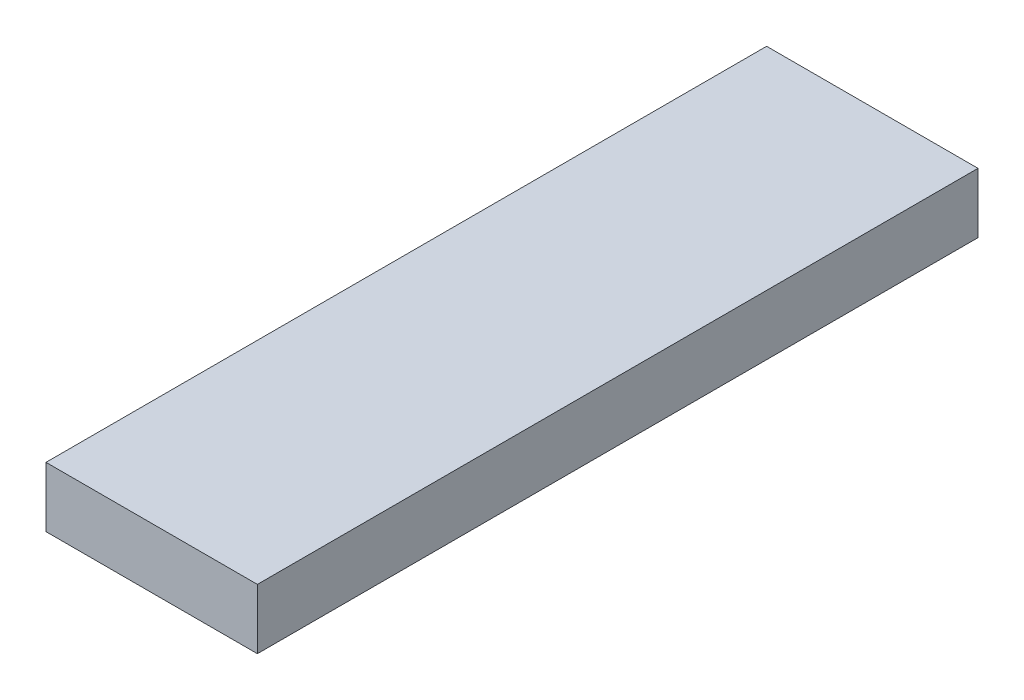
from build123d import *

# Parameters (mm, degrees)
SKETCH_1_W      = 44
SKETCH_1_H      = 150
EXTRUDE_1_DEPTH = 12.5


with BuildPart() as part:
    # Sketch 1 → Extrude 1 (new body)
    with BuildSketch(Plane(origin=(0, 0, 0), x_dir=(1, 0, 0), z_dir=(0, 1, 0))):
        with Locations((22, 75)):
            Rectangle(SKETCH_1_W, SKETCH_1_H)
    extrude(amount=EXTRUDE_1_DEPTH)


solid = part.part
